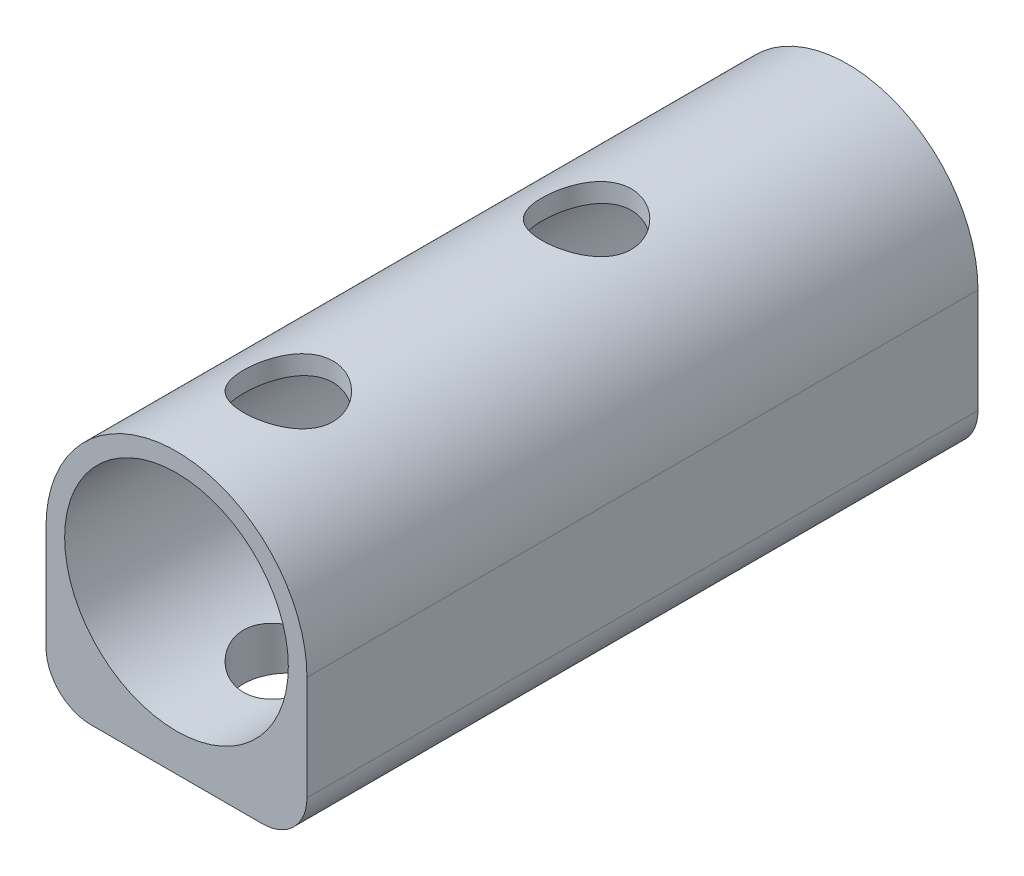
from build123d import *

# Parameters (mm, degrees)
BASE_EXTRUDE_DEPTH = 90
SKETCH2_R          = 15
CUT_EXTRUDE1_DEPTH = 94.841621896
SKETCH3_R          = 6
CUT_EXTRUDE2_DEPTH = 100.058063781
FILLET1_R          = 6


with BuildPart() as part:
    # Sketch1 → Base-Extrude (new body)
    with BuildSketch(Plane.XY):
        with BuildLine():
            Line((-17.5, -20), (-17.5, 0))
            ThreePointArc((-17.5, 0), (0, 17.5), (17.5, 0))
            Line((17.5, 0), (17.5, -20))
            Line((17.5, -20), (-17.5, -20))
        make_face()
    extrude(amount=BASE_EXTRUDE_DEPTH)

    # Sketch2 → Cut-Extrude1 (cut, through all)
    with BuildSketch(Plane.XY.offset(90)):
        Circle(SKETCH2_R)
    extrude(amount=-CUT_EXTRUDE1_DEPTH, mode=Mode.SUBTRACT)

    # Sketch3 → Cut-Extrude2 (cut, through all)
    with BuildSketch(Plane.XZ.offset(20)):
        with Locations((0, 35)):
            Circle(SKETCH3_R)
        with Locations((0, 75)):
            Circle(SKETCH3_R)
    extrude(amount=-CUT_EXTRUDE2_DEPTH, mode=Mode.SUBTRACT)

    # Fillet1
    fillet1_edges = [part.edges().sort_by_distance(p)[0] for p in [
        (17.5, -20, 45),
        (-17.5, -20, 45),
    ]]
    fillet(fillet1_edges, radius=FILLET1_R)


solid = part.part
